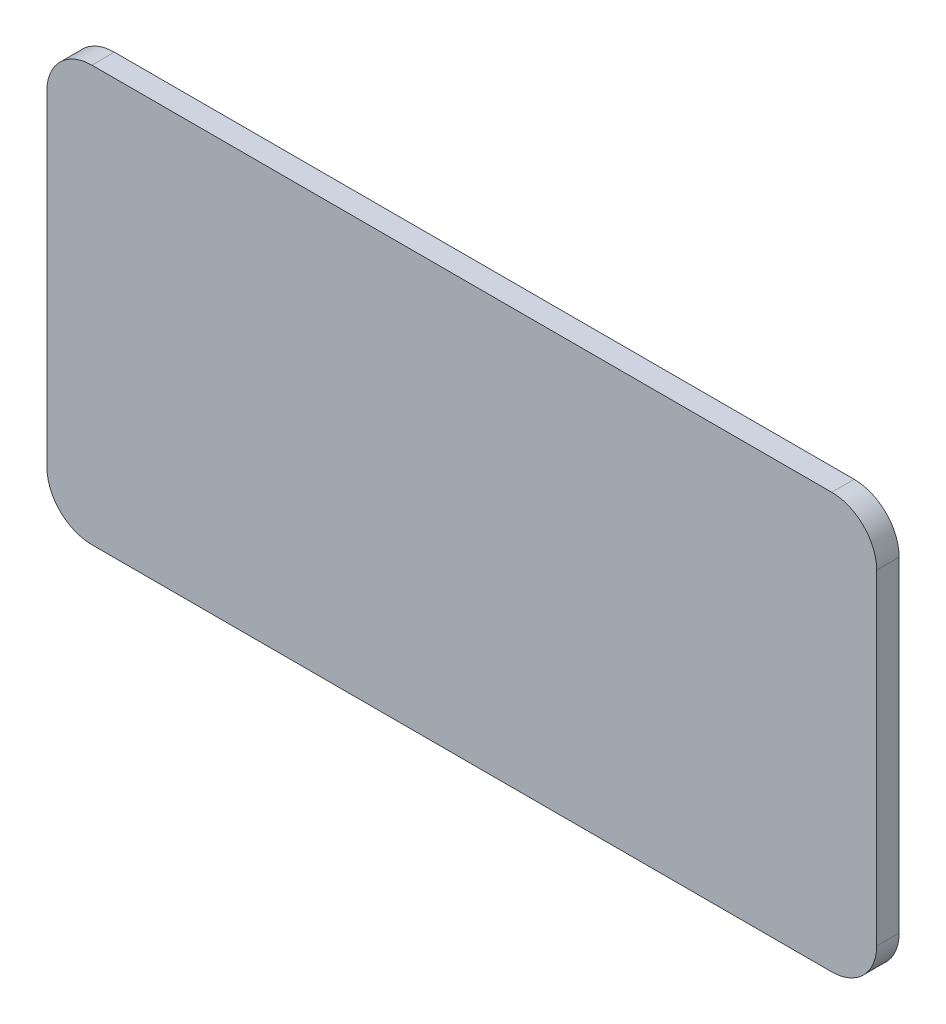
ISO-10303-21;
HEADER;
FILE_DESCRIPTION(('STEP AP214'),'2;1');
FILE_NAME('part.step','',(''),(''),'','','');
FILE_SCHEMA(('AUTOMOTIVE_DESIGN { 1 0 10303 214 1 1 1 1 }'));
ENDSEC;
DATA;
#1=APPLICATION_CONTEXT('core data for automotive mechanical design processes');
#2=APPLICATION_PROTOCOL_DEFINITION('international standard','automotive_design',2000,#1);
#3=PRODUCT_CONTEXT('',#1,'mechanical');
#4=PRODUCT('Part','Part','',(#3));
#5=PRODUCT_RELATED_PRODUCT_CATEGORY('part','',(#4));
#6=PRODUCT_DEFINITION_FORMATION('','',#4);
#7=PRODUCT_DEFINITION_CONTEXT('part definition',#1,'design');
#8=PRODUCT_DEFINITION('design','',#6,#7);
#9=PRODUCT_DEFINITION_SHAPE('','',#8);
#10=(LENGTH_UNIT() NAMED_UNIT(*) SI_UNIT(.MILLI.,.METRE.));
#11=(NAMED_UNIT(*) PLANE_ANGLE_UNIT() SI_UNIT($,.RADIAN.));
#12=(NAMED_UNIT(*) SI_UNIT($,.STERADIAN.) SOLID_ANGLE_UNIT());
#13=UNCERTAINTY_MEASURE_WITH_UNIT(LENGTH_MEASURE(1.E-05),#10,'distance_accuracy_value','');
#14=(GEOMETRIC_REPRESENTATION_CONTEXT(3) GLOBAL_UNCERTAINTY_ASSIGNED_CONTEXT((#13)) GLOBAL_UNIT_ASSIGNED_CONTEXT((#10,
#11,#12)) REPRESENTATION_CONTEXT('',''));
#15=CARTESIAN_POINT('',(0.,0.,0.));
#16=DIRECTION('',(0.,0.,1.));
#17=DIRECTION('',(1.,0.,0.));
#18=AXIS2_PLACEMENT_3D('',#15,#16,#17);
#19=CARTESIAN_POINT('',(78.15,147.2,6.));
#20=DIRECTION('',(0.,0.,-1.));
#21=DIRECTION('',(-1.,0.,0.));
#22=AXIS2_PLACEMENT_3D('',#19,#20,#21);
#23=CYLINDRICAL_SURFACE('',#22,5.);
#24=DIRECTION('',(0.,0.,-1.));
#25=VECTOR('',#24,1.);
#26=CARTESIAN_POINT('',(83.15,147.2,6.));
#27=LINE('',#26,#25);
#28=CARTESIAN_POINT('',(83.15,147.2,6.));
#29=VERTEX_POINT('',#28);
#30=CARTESIAN_POINT('',(83.15,147.2,3.5));
#31=VERTEX_POINT('',#30);
#32=EDGE_CURVE('E253',#29,#31,#27,.T.);
#33=ORIENTED_EDGE('',*,*,#32,.T.);
#34=CARTESIAN_POINT('',(78.15,147.2,3.5));
#35=DIRECTION('',(0.,0.,1.));
#36=DIRECTION('',(1.,0.,0.));
#37=AXIS2_PLACEMENT_3D('',#34,#35,#36);
#38=CIRCLE('',#37,5.);
#39=CARTESIAN_POINT('',(78.15,152.2,3.5));
#40=VERTEX_POINT('',#39);
#41=EDGE_CURVE('E47',#31,#40,#38,.T.);
#42=ORIENTED_EDGE('',*,*,#41,.T.);
#43=DIRECTION('',(0.,0.,-1.));
#44=VECTOR('',#43,1.);
#45=CARTESIAN_POINT('',(78.15,152.2,6.));
#46=LINE('',#45,#44);
#47=CARTESIAN_POINT('',(78.15,152.2,6.));
#48=VERTEX_POINT('',#47);
#49=EDGE_CURVE('E40',#48,#40,#46,.T.);
#50=ORIENTED_EDGE('',*,*,#49,.F.);
#51=CARTESIAN_POINT('',(78.15,147.2,6.));
#52=DIRECTION('',(0.,0.,1.));
#53=DIRECTION('',(-1.,0.,0.));
#54=AXIS2_PLACEMENT_3D('',#51,#52,#53);
#55=CIRCLE('',#54,5.);
#56=EDGE_CURVE('E236',#29,#48,#55,.T.);
#57=ORIENTED_EDGE('',*,*,#56,.F.);
#58=EDGE_LOOP('',(#33,#42,#50,#57));
#59=FACE_BOUND('',#58,.T.);
#60=ADVANCED_FACE('F33',(#59),#23,.T.);
#61=CARTESIAN_POINT('',(78.15,152.2,6.));
#62=DIRECTION('',(0.,-1.,0.));
#63=DIRECTION('',(0.,0.,-1.));
#64=AXIS2_PLACEMENT_3D('',#61,#62,#63);
#65=PLANE('',#64);
#66=ORIENTED_EDGE('',*,*,#49,.T.);
#67=DIRECTION('',(-1.,0.,0.));
#68=VECTOR('',#67,1.);
#69=CARTESIAN_POINT('',(78.15,152.2,3.5));
#70=LINE('',#69,#68);
#71=CARTESIAN_POINT('',(-4.15000000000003,152.2,3.5));
#72=VERTEX_POINT('',#71);
#73=EDGE_CURVE('E232',#40,#72,#70,.T.);
#74=ORIENTED_EDGE('',*,*,#73,.T.);
#75=DIRECTION('',(0.,0.,-1.));
#76=VECTOR('',#75,1.);
#77=CARTESIAN_POINT('',(-4.15000000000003,152.2,6.));
#78=LINE('',#77,#76);
#79=CARTESIAN_POINT('',(-4.15000000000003,152.2,6.));
#80=VERTEX_POINT('',#79);
#81=EDGE_CURVE('E271',#80,#72,#78,.T.);
#82=ORIENTED_EDGE('',*,*,#81,.F.);
#83=DIRECTION('',(-1.,0.,0.));
#84=VECTOR('',#83,1.);
#85=CARTESIAN_POINT('',(78.15,152.2,6.));
#86=LINE('',#85,#84);
#87=EDGE_CURVE('E239',#48,#80,#86,.T.);
#88=ORIENTED_EDGE('',*,*,#87,.F.);
#89=EDGE_LOOP('',(#66,#74,#82,#88));
#90=FACE_BOUND('',#89,.T.);
#91=ADVANCED_FACE('F276',(#90),#65,.F.);
#92=CARTESIAN_POINT('',(-4.15000000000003,147.2,6.));
#93=DIRECTION('',(0.,0.,-1.));
#94=DIRECTION('',(-1.,0.,0.));
#95=AXIS2_PLACEMENT_3D('',#92,#93,#94);
#96=CYLINDRICAL_SURFACE('',#95,5.);
#97=ORIENTED_EDGE('',*,*,#81,.T.);
#98=CARTESIAN_POINT('',(-4.15000000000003,147.2,3.5));
#99=DIRECTION('',(0.,0.,1.));
#100=DIRECTION('',(1.,0.,0.));
#101=AXIS2_PLACEMENT_3D('',#98,#99,#100);
#102=CIRCLE('',#101,5.);
#103=CARTESIAN_POINT('',(-9.15000000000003,147.2,3.5));
#104=VERTEX_POINT('',#103);
#105=EDGE_CURVE('E229',#72,#104,#102,.T.);
#106=ORIENTED_EDGE('',*,*,#105,.T.);
#107=DIRECTION('',(0.,0.,-1.));
#108=VECTOR('',#107,1.);
#109=CARTESIAN_POINT('',(-9.15000000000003,147.2,6.));
#110=LINE('',#109,#108);
#111=CARTESIAN_POINT('',(-9.15000000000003,147.2,6.));
#112=VERTEX_POINT('',#111);
#113=EDGE_CURVE('E268',#112,#104,#110,.T.);
#114=ORIENTED_EDGE('',*,*,#113,.F.);
#115=CARTESIAN_POINT('',(-4.15000000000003,147.2,6.));
#116=DIRECTION('',(0.,0.,1.));
#117=DIRECTION('',(1.,0.,0.));
#118=AXIS2_PLACEMENT_3D('',#115,#116,#117);
#119=CIRCLE('',#118,5.);
#120=EDGE_CURVE('E241',#80,#112,#119,.T.);
#121=ORIENTED_EDGE('',*,*,#120,.F.);
#122=EDGE_LOOP('',(#97,#106,#114,#121));
#123=FACE_BOUND('',#122,.T.);
#124=ADVANCED_FACE('F302',(#123),#96,.T.);
#125=CARTESIAN_POINT('',(-9.15000000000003,147.2,6.));
#126=DIRECTION('',(1.,0.,0.));
#127=DIRECTION('',(0.,1.,0.));
#128=AXIS2_PLACEMENT_3D('',#125,#126,#127);
#129=PLANE('',#128);
#130=ORIENTED_EDGE('',*,*,#113,.T.);
#131=DIRECTION('',(0.,-1.,0.));
#132=VECTOR('',#131,1.);
#133=CARTESIAN_POINT('',(-9.15000000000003,147.2,3.5));
#134=LINE('',#133,#132);
#135=CARTESIAN_POINT('',(-9.15000000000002,111.,3.5));
#136=VERTEX_POINT('',#135);
#137=EDGE_CURVE('E226',#104,#136,#134,.T.);
#138=ORIENTED_EDGE('',*,*,#137,.T.);
#139=DIRECTION('',(0.,0.,-1.));
#140=VECTOR('',#139,1.);
#141=CARTESIAN_POINT('',(-9.15000000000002,111.,6.));
#142=LINE('',#141,#140);
#143=CARTESIAN_POINT('',(-9.15000000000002,111.,6.));
#144=VERTEX_POINT('',#143);
#145=EDGE_CURVE('E265',#144,#136,#142,.T.);
#146=ORIENTED_EDGE('',*,*,#145,.F.);
#147=DIRECTION('',(0.,-1.,0.));
#148=VECTOR('',#147,1.);
#149=CARTESIAN_POINT('',(-9.15000000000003,147.2,6.));
#150=LINE('',#149,#148);
#151=EDGE_CURVE('E243',#112,#144,#150,.T.);
#152=ORIENTED_EDGE('',*,*,#151,.F.);
#153=EDGE_LOOP('',(#130,#138,#146,#152));
#154=FACE_BOUND('',#153,.T.);
#155=ADVANCED_FACE('F299',(#154),#129,.F.);
#156=CARTESIAN_POINT('',(-4.15000000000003,111.,6.));
#157=DIRECTION('',(0.,0.,-1.));
#158=DIRECTION('',(-1.,0.,0.));
#159=AXIS2_PLACEMENT_3D('',#156,#157,#158);
#160=CYLINDRICAL_SURFACE('',#159,4.99999999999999);
#161=ORIENTED_EDGE('',*,*,#145,.T.);
#162=CARTESIAN_POINT('',(-4.15000000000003,111.,3.5));
#163=DIRECTION('',(0.,0.,1.));
#164=DIRECTION('',(1.,0.,0.));
#165=AXIS2_PLACEMENT_3D('',#162,#163,#164);
#166=CIRCLE('',#165,4.99999999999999);
#167=CARTESIAN_POINT('',(-4.15000000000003,106.,3.5));
#168=VERTEX_POINT('',#167);
#169=EDGE_CURVE('E223',#136,#168,#166,.T.);
#170=ORIENTED_EDGE('',*,*,#169,.T.);
#171=DIRECTION('',(0.,0.,-1.));
#172=VECTOR('',#171,1.);
#173=CARTESIAN_POINT('',(-4.15000000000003,106.,6.));
#174=LINE('',#173,#172);
#175=CARTESIAN_POINT('',(-4.15000000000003,106.,6.));
#176=VERTEX_POINT('',#175);
#177=EDGE_CURVE('E262',#176,#168,#174,.T.);
#178=ORIENTED_EDGE('',*,*,#177,.F.);
#179=CARTESIAN_POINT('',(-4.15000000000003,111.,6.));
#180=DIRECTION('',(0.,0.,1.));
#181=DIRECTION('',(-1.,0.,0.));
#182=AXIS2_PLACEMENT_3D('',#179,#180,#181);
#183=CIRCLE('',#182,4.99999999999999);
#184=EDGE_CURVE('E245',#144,#176,#183,.T.);
#185=ORIENTED_EDGE('',*,*,#184,.F.);
#186=EDGE_LOOP('',(#161,#170,#178,#185));
#187=FACE_BOUND('',#186,.T.);
#188=ADVANCED_FACE('F294',(#187),#160,.T.);
#189=CARTESIAN_POINT('',(78.15,106.,6.));
#190=DIRECTION('',(0.,1.,0.));
#191=DIRECTION('',(0.,0.,1.));
#192=AXIS2_PLACEMENT_3D('',#189,#190,#191);
#193=PLANE('',#192);
#194=ORIENTED_EDGE('',*,*,#177,.T.);
#195=DIRECTION('',(1.,0.,0.));
#196=VECTOR('',#195,1.);
#197=CARTESIAN_POINT('',(78.15,106.,3.5));
#198=LINE('',#197,#196);
#199=CARTESIAN_POINT('',(78.15,106.,3.5));
#200=VERTEX_POINT('',#199);
#201=EDGE_CURVE('E220',#168,#200,#198,.T.);
#202=ORIENTED_EDGE('',*,*,#201,.T.);
#203=DIRECTION('',(0.,0.,-1.));
#204=VECTOR('',#203,1.);
#205=CARTESIAN_POINT('',(78.15,106.,6.));
#206=LINE('',#205,#204);
#207=CARTESIAN_POINT('',(78.15,106.,6.));
#208=VERTEX_POINT('',#207);
#209=EDGE_CURVE('E259',#208,#200,#206,.T.);
#210=ORIENTED_EDGE('',*,*,#209,.F.);
#211=DIRECTION('',(1.,0.,0.));
#212=VECTOR('',#211,1.);
#213=CARTESIAN_POINT('',(78.15,106.,6.));
#214=LINE('',#213,#212);
#215=EDGE_CURVE('E247',#176,#208,#214,.T.);
#216=ORIENTED_EDGE('',*,*,#215,.F.);
#217=EDGE_LOOP('',(#194,#202,#210,#216));
#218=FACE_BOUND('',#217,.T.);
#219=ADVANCED_FACE('F291',(#218),#193,.F.);
#220=CARTESIAN_POINT('',(78.15,111.,6.));
#221=DIRECTION('',(0.,0.,-1.));
#222=DIRECTION('',(-1.,0.,0.));
#223=AXIS2_PLACEMENT_3D('',#220,#221,#222);
#224=CYLINDRICAL_SURFACE('',#223,5.);
#225=ORIENTED_EDGE('',*,*,#209,.T.);
#226=CARTESIAN_POINT('',(78.15,111.,3.5));
#227=DIRECTION('',(0.,0.,1.));
#228=DIRECTION('',(1.,0.,0.));
#229=AXIS2_PLACEMENT_3D('',#226,#227,#228);
#230=CIRCLE('',#229,5.);
#231=CARTESIAN_POINT('',(83.15,111.,3.5));
#232=VERTEX_POINT('',#231);
#233=EDGE_CURVE('E206',#200,#232,#230,.T.);
#234=ORIENTED_EDGE('',*,*,#233,.T.);
#235=DIRECTION('',(0.,0.,-1.));
#236=VECTOR('',#235,1.);
#237=CARTESIAN_POINT('',(83.15,111.,6.));
#238=LINE('',#237,#236);
#239=CARTESIAN_POINT('',(83.15,111.,6.));
#240=VERTEX_POINT('',#239);
#241=EDGE_CURVE('E256',#240,#232,#238,.T.);
#242=ORIENTED_EDGE('',*,*,#241,.F.);
#243=CARTESIAN_POINT('',(78.15,111.,6.));
#244=DIRECTION('',(0.,0.,1.));
#245=DIRECTION('',(-1.,0.,0.));
#246=AXIS2_PLACEMENT_3D('',#243,#244,#245);
#247=CIRCLE('',#246,5.);
#248=EDGE_CURVE('E249',#208,#240,#247,.T.);
#249=ORIENTED_EDGE('',*,*,#248,.F.);
#250=EDGE_LOOP('',(#225,#234,#242,#249));
#251=FACE_BOUND('',#250,.T.);
#252=ADVANCED_FACE('F286',(#251),#224,.T.);
#253=CARTESIAN_POINT('',(83.15,147.2,6.));
#254=DIRECTION('',(-1.,0.,0.));
#255=DIRECTION('',(0.,0.,1.));
#256=AXIS2_PLACEMENT_3D('',#253,#254,#255);
#257=PLANE('',#256);
#258=ORIENTED_EDGE('',*,*,#241,.T.);
#259=DIRECTION('',(0.,1.,0.));
#260=VECTOR('',#259,1.);
#261=CARTESIAN_POINT('',(83.15,147.2,3.5));
#262=LINE('',#261,#260);
#263=EDGE_CURVE('E11',#232,#31,#262,.T.);
#264=ORIENTED_EDGE('',*,*,#263,.T.);
#265=ORIENTED_EDGE('',*,*,#32,.F.);
#266=DIRECTION('',(0.,1.,0.));
#267=VECTOR('',#266,1.);
#268=CARTESIAN_POINT('',(83.15,147.2,6.));
#269=LINE('',#268,#267);
#270=EDGE_CURVE('E251',#240,#29,#269,.T.);
#271=ORIENTED_EDGE('',*,*,#270,.F.);
#272=EDGE_LOOP('',(#258,#264,#265,#271));
#273=FACE_BOUND('',#272,.T.);
#274=ADVANCED_FACE('F283',(#273),#257,.F.);
#275=CARTESIAN_POINT('',(78.15,147.2,6.));
#276=DIRECTION('',(0.,0.,-1.));
#277=DIRECTION('',(-1.,0.,0.));
#278=AXIS2_PLACEMENT_3D('',#275,#276,#277);
#279=PLANE('',#278);
#280=ORIENTED_EDGE('',*,*,#56,.T.);
#281=ORIENTED_EDGE('',*,*,#87,.T.);
#282=ORIENTED_EDGE('',*,*,#120,.T.);
#283=ORIENTED_EDGE('',*,*,#151,.T.);
#284=ORIENTED_EDGE('',*,*,#184,.T.);
#285=ORIENTED_EDGE('',*,*,#215,.T.);
#286=ORIENTED_EDGE('',*,*,#248,.T.);
#287=ORIENTED_EDGE('',*,*,#270,.T.);
#288=EDGE_LOOP('',(#280,#281,#282,#283,#284,#285,#286,#287));
#289=FACE_BOUND('',#288,.T.);
#290=ADVANCED_FACE('F305',(#289),#279,.F.);
#291=CARTESIAN_POINT('',(0.,0.,3.5));
#292=DIRECTION('',(0.,0.,1.));
#293=DIRECTION('',(1.,0.,0.));
#294=AXIS2_PLACEMENT_3D('',#291,#292,#293);
#295=PLANE('',#294);
#296=CARTESIAN_POINT('',(1.84999999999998,141.2,3.5));
#297=DIRECTION('',(0.,0.,-1.));
#298=DIRECTION('',(1.,0.,0.));
#299=AXIS2_PLACEMENT_3D('',#296,#297,#298);
#300=CIRCLE('',#299,1.);
#301=CARTESIAN_POINT('',(0.849999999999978,141.2,3.5));
#302=VERTEX_POINT('',#301);
#303=CARTESIAN_POINT('',(1.84999999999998,142.2,3.5));
#304=VERTEX_POINT('',#303);
#305=EDGE_CURVE('E162',#302,#304,#300,.T.);
#306=ORIENTED_EDGE('',*,*,#305,.F.);
#307=DIRECTION('',(0.,1.,0.));
#308=VECTOR('',#307,1.);
#309=CARTESIAN_POINT('',(0.849999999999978,117.,3.5));
#310=LINE('',#309,#308);
#311=CARTESIAN_POINT('',(0.849999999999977,117.,3.5));
#312=VERTEX_POINT('',#311);
#313=EDGE_CURVE('E156',#312,#302,#310,.T.);
#314=ORIENTED_EDGE('',*,*,#313,.F.);
#315=CARTESIAN_POINT('',(1.84999999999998,117.,3.5));
#316=DIRECTION('',(0.,0.,-1.));
#317=DIRECTION('',(-1.,0.,0.));
#318=AXIS2_PLACEMENT_3D('',#315,#316,#317);
#319=CIRCLE('',#318,1.);
#320=CARTESIAN_POINT('',(1.84999999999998,116.,3.5));
#321=VERTEX_POINT('',#320);
#322=EDGE_CURVE('E186',#321,#312,#319,.T.);
#323=ORIENTED_EDGE('',*,*,#322,.F.);
#324=DIRECTION('',(-1.,0.,0.));
#325=VECTOR('',#324,1.);
#326=CARTESIAN_POINT('',(72.15,116.,3.5));
#327=LINE('',#326,#325);
#328=CARTESIAN_POINT('',(72.15,116.,3.5));
#329=VERTEX_POINT('',#328);
#330=EDGE_CURVE('E183',#329,#321,#327,.T.);
#331=ORIENTED_EDGE('',*,*,#330,.F.);
#332=CARTESIAN_POINT('',(72.15,117.,3.5));
#333=DIRECTION('',(0.,0.,-1.));
#334=DIRECTION('',(1.,0.,0.));
#335=AXIS2_PLACEMENT_3D('',#332,#333,#334);
#336=CIRCLE('',#335,1.);
#337=CARTESIAN_POINT('',(73.15,117.,3.5));
#338=VERTEX_POINT('',#337);
#339=EDGE_CURVE('E180',#338,#329,#336,.T.);
#340=ORIENTED_EDGE('',*,*,#339,.F.);
#341=DIRECTION('',(0.,-1.,0.));
#342=VECTOR('',#341,1.);
#343=CARTESIAN_POINT('',(73.15,117.,3.5));
#344=LINE('',#343,#342);
#345=CARTESIAN_POINT('',(73.15,141.2,3.5));
#346=VERTEX_POINT('',#345);
#347=EDGE_CURVE('E177',#346,#338,#344,.T.);
#348=ORIENTED_EDGE('',*,*,#347,.F.);
#349=CARTESIAN_POINT('',(72.15,141.2,3.5));
#350=DIRECTION('',(0.,0.,-1.));
#351=DIRECTION('',(1.,0.,0.));
#352=AXIS2_PLACEMENT_3D('',#349,#350,#351);
#353=CIRCLE('',#352,1.);
#354=CARTESIAN_POINT('',(72.15,142.2,3.5));
#355=VERTEX_POINT('',#354);
#356=EDGE_CURVE('E166',#355,#346,#353,.T.);
#357=ORIENTED_EDGE('',*,*,#356,.F.);
#358=DIRECTION('',(1.,0.,0.));
#359=VECTOR('',#358,1.);
#360=CARTESIAN_POINT('',(72.15,142.2,3.5));
#361=LINE('',#360,#359);
#362=EDGE_CURVE('E148',#304,#355,#361,.T.);
#363=ORIENTED_EDGE('',*,*,#362,.F.);
#364=EDGE_LOOP('',(#306,#314,#323,#331,#340,#348,#357,#363));
#365=FACE_BOUND('',#364,.T.);
#366=ORIENTED_EDGE('',*,*,#263,.F.);
#367=ORIENTED_EDGE('',*,*,#233,.F.);
#368=ORIENTED_EDGE('',*,*,#201,.F.);
#369=ORIENTED_EDGE('',*,*,#169,.F.);
#370=ORIENTED_EDGE('',*,*,#137,.F.);
#371=ORIENTED_EDGE('',*,*,#105,.F.);
#372=ORIENTED_EDGE('',*,*,#73,.F.);
#373=ORIENTED_EDGE('',*,*,#41,.F.);
#374=EDGE_LOOP('',(#366,#367,#368,#369,#370,#371,#372,#373));
#375=FACE_BOUND('',#374,.T.);
#376=ADVANCED_FACE('F160',(#365,#375),#295,.F.);
#377=CARTESIAN_POINT('',(1.84999999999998,141.2,3.5));
#378=DIRECTION('',(0.,0.,-1.));
#379=DIRECTION('',(-1.,0.,0.));
#380=AXIS2_PLACEMENT_3D('',#377,#378,#379);
#381=CYLINDRICAL_SURFACE('',#380,1.);
#382=CARTESIAN_POINT('',(1.84999999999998,141.2,0.));
#383=DIRECTION('',(0.,0.,-1.));
#384=DIRECTION('',(1.,0.,0.));
#385=AXIS2_PLACEMENT_3D('',#382,#383,#384);
#386=CIRCLE('',#385,1.);
#387=CARTESIAN_POINT('',(0.849999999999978,141.2,0.));
#388=VERTEX_POINT('',#387);
#389=CARTESIAN_POINT('',(1.84999999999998,142.2,0.));
#390=VERTEX_POINT('',#389);
#391=EDGE_CURVE('E190',#388,#390,#386,.T.);
#392=ORIENTED_EDGE('',*,*,#391,.F.);
#393=DIRECTION('',(0.,0.,-1.));
#394=VECTOR('',#393,1.);
#395=CARTESIAN_POINT('',(0.849999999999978,141.2,3.5));
#396=LINE('',#395,#394);
#397=EDGE_CURVE('E169',#302,#388,#396,.T.);
#398=ORIENTED_EDGE('',*,*,#397,.F.);
#399=ORIENTED_EDGE('',*,*,#305,.T.);
#400=DIRECTION('',(0.,0.,-1.));
#401=VECTOR('',#400,1.);
#402=CARTESIAN_POINT('',(1.84999999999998,142.2,3.5));
#403=LINE('',#402,#401);
#404=EDGE_CURVE('E145',#304,#390,#403,.T.);
#405=ORIENTED_EDGE('',*,*,#404,.T.);
#406=EDGE_LOOP('',(#392,#398,#399,#405));
#407=FACE_BOUND('',#406,.T.);
#408=ADVANCED_FACE('F168',(#407),#381,.T.);
#409=CARTESIAN_POINT('',(0.849999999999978,117.,3.5));
#410=DIRECTION('',(-1.,0.,0.));
#411=DIRECTION('',(0.,0.,1.));
#412=AXIS2_PLACEMENT_3D('',#409,#410,#411);
#413=PLANE('',#412);
#414=DIRECTION('',(0.,1.,0.));
#415=VECTOR('',#414,1.);
#416=CARTESIAN_POINT('',(0.849999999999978,117.,0.));
#417=LINE('',#416,#415);
#418=CARTESIAN_POINT('',(0.849999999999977,117.,0.));
#419=VERTEX_POINT('',#418);
#420=EDGE_CURVE('E170',#419,#388,#417,.T.);
#421=ORIENTED_EDGE('',*,*,#420,.F.);
#422=DIRECTION('',(0.,0.,-1.));
#423=VECTOR('',#422,1.);
#424=CARTESIAN_POINT('',(0.849999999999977,117.,3.5));
#425=LINE('',#424,#423);
#426=EDGE_CURVE('E207',#312,#419,#425,.T.);
#427=ORIENTED_EDGE('',*,*,#426,.F.);
#428=ORIENTED_EDGE('',*,*,#313,.T.);
#429=ORIENTED_EDGE('',*,*,#397,.T.);
#430=EDGE_LOOP('',(#421,#427,#428,#429));
#431=FACE_BOUND('',#430,.T.);
#432=ADVANCED_FACE('F342',(#431),#413,.T.);
#433=CARTESIAN_POINT('',(1.84999999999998,117.,3.5));
#434=DIRECTION('',(0.,0.,-1.));
#435=DIRECTION('',(-1.,0.,0.));
#436=AXIS2_PLACEMENT_3D('',#433,#434,#435);
#437=CYLINDRICAL_SURFACE('',#436,1.);
#438=CARTESIAN_POINT('',(1.84999999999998,117.,0.));
#439=DIRECTION('',(0.,0.,-1.));
#440=DIRECTION('',(-1.,0.,0.));
#441=AXIS2_PLACEMENT_3D('',#438,#439,#440);
#442=CIRCLE('',#441,1.);
#443=CARTESIAN_POINT('',(1.84999999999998,116.,0.));
#444=VERTEX_POINT('',#443);
#445=EDGE_CURVE('E173',#444,#419,#442,.T.);
#446=ORIENTED_EDGE('',*,*,#445,.F.);
#447=DIRECTION('',(0.,0.,-1.));
#448=VECTOR('',#447,1.);
#449=CARTESIAN_POINT('',(1.84999999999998,116.,3.5));
#450=LINE('',#449,#448);
#451=EDGE_CURVE('E209',#321,#444,#450,.T.);
#452=ORIENTED_EDGE('',*,*,#451,.F.);
#453=ORIENTED_EDGE('',*,*,#322,.T.);
#454=ORIENTED_EDGE('',*,*,#426,.T.);
#455=EDGE_LOOP('',(#446,#452,#453,#454));
#456=FACE_BOUND('',#455,.T.);
#457=ADVANCED_FACE('F346',(#456),#437,.T.);
#458=CARTESIAN_POINT('',(72.15,116.,3.5));
#459=DIRECTION('',(0.,-1.,0.));
#460=DIRECTION('',(0.,0.,-1.));
#461=AXIS2_PLACEMENT_3D('',#458,#459,#460);
#462=PLANE('',#461);
#463=DIRECTION('',(-1.,0.,0.));
#464=VECTOR('',#463,1.);
#465=CARTESIAN_POINT('',(72.15,116.,0.));
#466=LINE('',#465,#464);
#467=CARTESIAN_POINT('',(72.15,116.,0.));
#468=VERTEX_POINT('',#467);
#469=EDGE_CURVE('E200',#468,#444,#466,.T.);
#470=ORIENTED_EDGE('',*,*,#469,.F.);
#471=DIRECTION('',(0.,0.,-1.));
#472=VECTOR('',#471,1.);
#473=CARTESIAN_POINT('',(72.15,116.,3.5));
#474=LINE('',#473,#472);
#475=EDGE_CURVE('E211',#329,#468,#474,.T.);
#476=ORIENTED_EDGE('',*,*,#475,.F.);
#477=ORIENTED_EDGE('',*,*,#330,.T.);
#478=ORIENTED_EDGE('',*,*,#451,.T.);
#479=EDGE_LOOP('',(#470,#476,#477,#478));
#480=FACE_BOUND('',#479,.T.);
#481=ADVANCED_FACE('F349',(#480),#462,.T.);
#482=CARTESIAN_POINT('',(72.15,117.,3.5));
#483=DIRECTION('',(0.,0.,-1.));
#484=DIRECTION('',(-1.,0.,0.));
#485=AXIS2_PLACEMENT_3D('',#482,#483,#484);
#486=CYLINDRICAL_SURFACE('',#485,1.);
#487=CARTESIAN_POINT('',(72.15,117.,0.));
#488=DIRECTION('',(0.,0.,-1.));
#489=DIRECTION('',(1.,0.,0.));
#490=AXIS2_PLACEMENT_3D('',#487,#488,#489);
#491=CIRCLE('',#490,1.);
#492=CARTESIAN_POINT('',(73.15,117.,0.));
#493=VERTEX_POINT('',#492);
#494=EDGE_CURVE('E197',#493,#468,#491,.T.);
#495=ORIENTED_EDGE('',*,*,#494,.F.);
#496=DIRECTION('',(0.,0.,-1.));
#497=VECTOR('',#496,1.);
#498=CARTESIAN_POINT('',(73.15,117.,3.5));
#499=LINE('',#498,#497);
#500=EDGE_CURVE('E213',#338,#493,#499,.T.);
#501=ORIENTED_EDGE('',*,*,#500,.F.);
#502=ORIENTED_EDGE('',*,*,#339,.T.);
#503=ORIENTED_EDGE('',*,*,#475,.T.);
#504=EDGE_LOOP('',(#495,#501,#502,#503));
#505=FACE_BOUND('',#504,.T.);
#506=ADVANCED_FACE('F353',(#505),#486,.T.);
#507=CARTESIAN_POINT('',(73.15,117.,3.5));
#508=DIRECTION('',(1.,0.,0.));
#509=DIRECTION('',(0.,0.,-1.));
#510=AXIS2_PLACEMENT_3D('',#507,#508,#509);
#511=PLANE('',#510);
#512=DIRECTION('',(0.,-1.,0.));
#513=VECTOR('',#512,1.);
#514=CARTESIAN_POINT('',(73.15,117.,0.));
#515=LINE('',#514,#513);
#516=CARTESIAN_POINT('',(73.15,141.2,0.));
#517=VERTEX_POINT('',#516);
#518=EDGE_CURVE('E194',#517,#493,#515,.T.);
#519=ORIENTED_EDGE('',*,*,#518,.F.);
#520=DIRECTION('',(0.,0.,-1.));
#521=VECTOR('',#520,1.);
#522=CARTESIAN_POINT('',(73.15,141.2,3.5));
#523=LINE('',#522,#521);
#524=EDGE_CURVE('E215',#346,#517,#523,.T.);
#525=ORIENTED_EDGE('',*,*,#524,.F.);
#526=ORIENTED_EDGE('',*,*,#347,.T.);
#527=ORIENTED_EDGE('',*,*,#500,.T.);
#528=EDGE_LOOP('',(#519,#525,#526,#527));
#529=FACE_BOUND('',#528,.T.);
#530=ADVANCED_FACE('F356',(#529),#511,.T.);
#531=CARTESIAN_POINT('',(72.15,141.2,3.5));
#532=DIRECTION('',(0.,0.,-1.));
#533=DIRECTION('',(-1.,0.,0.));
#534=AXIS2_PLACEMENT_3D('',#531,#532,#533);
#535=CYLINDRICAL_SURFACE('',#534,1.);
#536=CARTESIAN_POINT('',(72.15,141.2,0.));
#537=DIRECTION('',(0.,0.,-1.));
#538=DIRECTION('',(1.,0.,0.));
#539=AXIS2_PLACEMENT_3D('',#536,#537,#538);
#540=CIRCLE('',#539,1.);
#541=CARTESIAN_POINT('',(72.15,142.2,0.));
#542=VERTEX_POINT('',#541);
#543=EDGE_CURVE('E54',#542,#517,#540,.T.);
#544=ORIENTED_EDGE('',*,*,#543,.F.);
#545=DIRECTION('',(0.,0.,-1.));
#546=VECTOR('',#545,1.);
#547=CARTESIAN_POINT('',(72.15,142.2,3.5));
#548=LINE('',#547,#546);
#549=EDGE_CURVE('E155',#355,#542,#548,.T.);
#550=ORIENTED_EDGE('',*,*,#549,.F.);
#551=ORIENTED_EDGE('',*,*,#356,.T.);
#552=ORIENTED_EDGE('',*,*,#524,.T.);
#553=EDGE_LOOP('',(#544,#550,#551,#552));
#554=FACE_BOUND('',#553,.T.);
#555=ADVANCED_FACE('F337',(#554),#535,.T.);
#556=CARTESIAN_POINT('',(72.15,142.2,3.5));
#557=DIRECTION('',(0.,1.,0.));
#558=DIRECTION('',(0.,0.,1.));
#559=AXIS2_PLACEMENT_3D('',#556,#557,#558);
#560=PLANE('',#559);
#561=DIRECTION('',(1.,0.,0.));
#562=VECTOR('',#561,1.);
#563=CARTESIAN_POINT('',(72.15,142.2,0.));
#564=LINE('',#563,#562);
#565=EDGE_CURVE('E150',#390,#542,#564,.T.);
#566=ORIENTED_EDGE('',*,*,#565,.F.);
#567=ORIENTED_EDGE('',*,*,#404,.F.);
#568=ORIENTED_EDGE('',*,*,#362,.T.);
#569=ORIENTED_EDGE('',*,*,#549,.T.);
#570=EDGE_LOOP('',(#566,#567,#568,#569));
#571=FACE_BOUND('',#570,.T.);
#572=ADVANCED_FACE('F147',(#571),#560,.T.);
#573=CARTESIAN_POINT('',(78.15,147.2,0.));
#574=DIRECTION('',(0.,0.,-1.));
#575=DIRECTION('',(-1.,0.,0.));
#576=AXIS2_PLACEMENT_3D('',#573,#574,#575);
#577=PLANE('',#576);
#578=ORIENTED_EDGE('',*,*,#420,.T.);
#579=ORIENTED_EDGE('',*,*,#391,.T.);
#580=ORIENTED_EDGE('',*,*,#565,.T.);
#581=ORIENTED_EDGE('',*,*,#543,.T.);
#582=ORIENTED_EDGE('',*,*,#518,.T.);
#583=ORIENTED_EDGE('',*,*,#494,.T.);
#584=ORIENTED_EDGE('',*,*,#469,.T.);
#585=ORIENTED_EDGE('',*,*,#445,.T.);
#586=EDGE_LOOP('',(#578,#579,#580,#581,#582,#583,#584,#585));
#587=FACE_BOUND('',#586,.T.);
#588=ADVANCED_FACE('F331',(#587),#577,.T.);
#589=CLOSED_SHELL('',(#60,#91,#124,#155,#188,#219,#252,#274,#290,#376,#408,#432,#457,#481,#506,
#530,#555,#572,#588));
#590=MANIFOLD_SOLID_BREP('B2',#589);
#591=ADVANCED_BREP_SHAPE_REPRESENTATION('',(#18,#590),#14);
#592=SHAPE_DEFINITION_REPRESENTATION(#9,#591);
ENDSEC;
END-ISO-10303-21;
